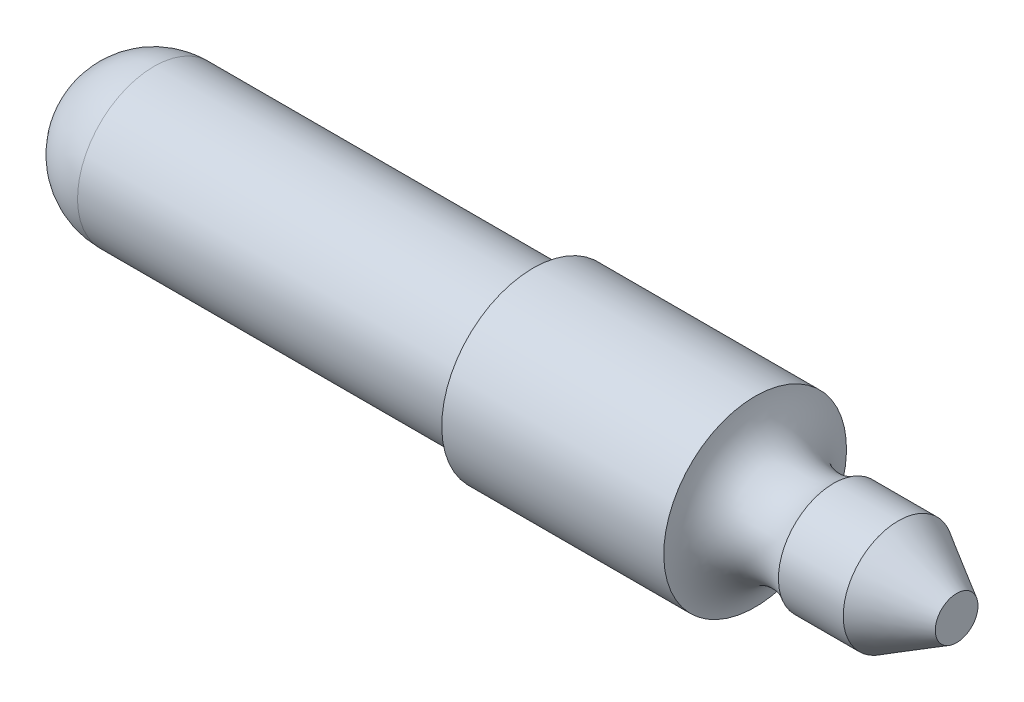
from build123d import *


with BuildPart() as part:
    # Sketch1 → Revolve1 (revolve)
    with BuildSketch(Plane.XY):
        with BuildLine():
            Line((0, 0), (-11.938, 0))
            Line((-11.938, 0), (-13.075, 0))
            ThreePointArc((-13.075, 0), (-12.74198041, 0.80398041), (-11.938, 1.137))
            Line((-11.938, 1.137), (-6.299, 1.137))
            Line((-6.299, 1.137), (-6.299, 1.359))
            Line((-6.299, 1.359), (-2.997, 1.359))
            ThreePointArc((-2.997, 1.359), (-2.562171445, 0.76959342), (-1.831394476, 0.819))
            Line((-1.831394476, 0.819), (-0.867757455, 0.819))
            Line((-0.867757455, 0.819), (0, 0.318))
            Line((0, 0.318), (0, 0))
        make_face()
    revolve(axis=Axis((0, 0, 0), (-1, 0, 0)))


solid = part.part
